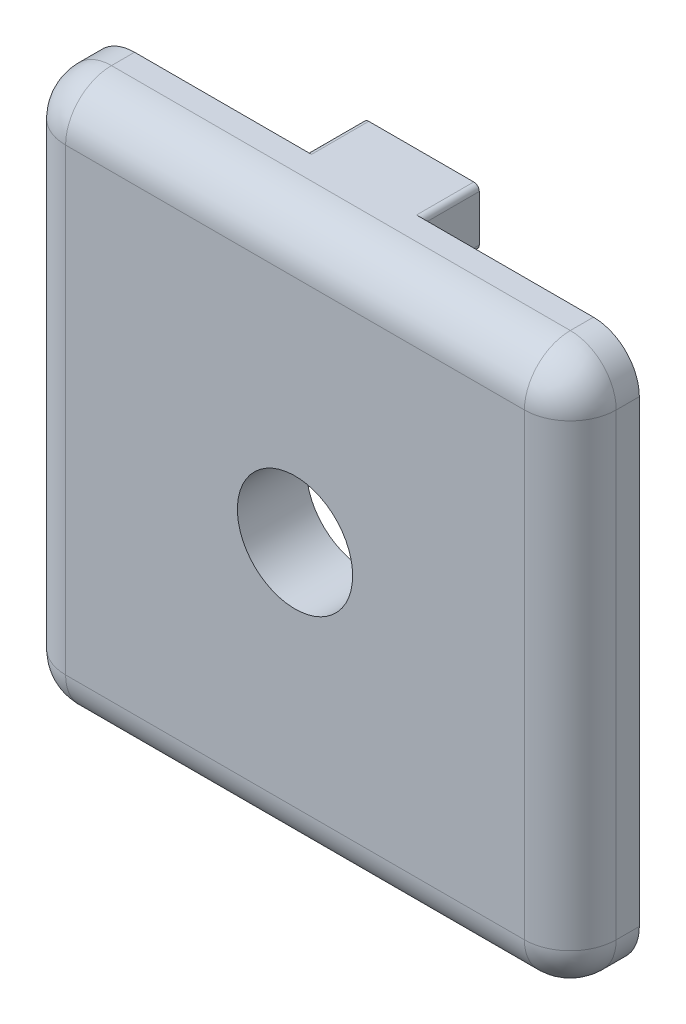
from build123d import *

# Parameters (mm, degrees)
SKETCH1_W           = 38.1
SKETCH1_H           = 38.1
BOSS_EXTRUDE1_DEPTH = 4.7752
FILLET1_R           = 3.175
CUT_EXTRUDE1_REACH  = 29.361
SKETCH2_R           = 3.9878
SKETCH3_W           = 8.0264
SKETCH3_H           = 3.9624
BOSS_EXTRUDE2_DEPTH = 3.9624
FILLET2_R           = 0.381


with BuildPart() as part:
    # Sketch1 → Boss-Extrude1 (new body)
    with BuildSketch(Plane.XY):
        Rectangle(SKETCH1_W, SKETCH1_H)
    extrude(amount=BOSS_EXTRUDE1_DEPTH)

    # Fillet1
    fillet1_edges = [part.edges().sort_by_distance(p)[0] for p in [
        (19.05, 0, 4.7752),
        (0, 19.05, 4.7752),
        (-19.05, 0, 4.7752),
        (0, -19.05, 4.7752),
        (-19.05, 19.05, 2.3876),
        (19.05, 19.05, 2.3876),
        (19.05, -19.05, 2.3876),
        (-19.05, -19.05, 2.3876),
    ]]
    fillet(fillet1_edges, radius=FILLET1_R)

    # Sketch2 → Cut-Extrude1 (cut, up to next)
    with BuildSketch(Plane.XY.offset(4.7752), mode=Mode.PRIVATE) as cut_extrude1_sk1:
        Circle(SKETCH2_R)
    cut_extrude1_tool1 = extrude(cut_extrude1_sk1.sketch, amount=-CUT_EXTRUDE1_REACH, mode=Mode.PRIVATE) & part.part
    add(cut_extrude1_tool1.solids().sort_by_distance((0, 0, 4.7752))[0], mode=Mode.SUBTRACT)

    # Sketch3 → Boss-Extrude2 (add)
    with BuildSketch(Plane(origin=(0, 0, 0), x_dir=(-1, 0, 0), z_dir=(0, 0, -1))):
        with Locations((0, 17.0688)):
            Rectangle(SKETCH3_W, SKETCH3_H)
    extrude(amount=BOSS_EXTRUDE2_DEPTH)

    # Fillet2
    fillet2_edges = [part.edges().sort_by_distance(p)[0] for p in [
        (-4.0132, 15.0876, -1.9812),
        (4.0132, 15.0876, -1.9812),
        (-4.0132, 19.05, -1.9812),
        (4.0132, 19.05, -1.9812),
    ]]
    fillet(fillet2_edges, radius=FILLET2_R)


solid = part.part
